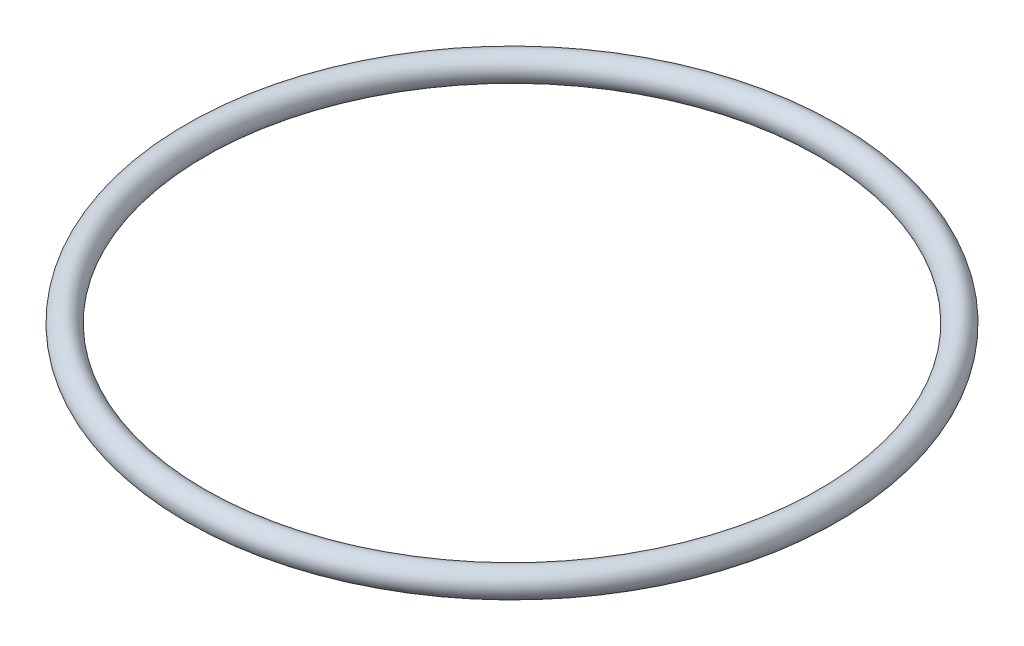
from build123d import *

# Parameters (mm, degrees)
SKETCH1_R = 0.5


with BuildPart() as part:
    # Sketch1 → Revolve1 (revolve)
    with BuildSketch(Plane.XY, mode=Mode.PRIVATE) as revolve1_sk:
        with Locations((-12, 0)):
            Circle(SKETCH1_R)
    revolve(revolve1_sk.sketch.rotate(Axis((0, 0, 0), (0, 1, 0)), 270), axis=Axis((0, 0, 0), (0, 1, 0)))


solid = part.part
